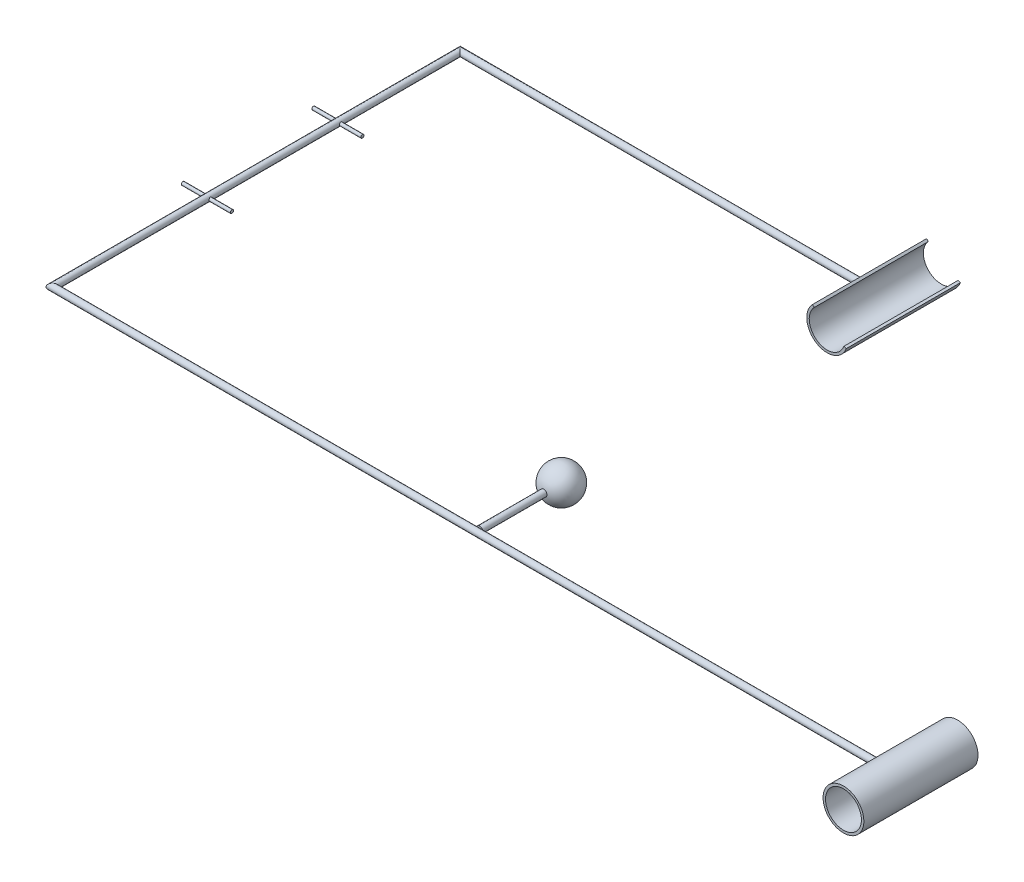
ISO-10303-21;
HEADER;
FILE_DESCRIPTION(('STEP AP214'),'2;1');
FILE_NAME('part.step','',(''),(''),'','','');
FILE_SCHEMA(('AUTOMOTIVE_DESIGN { 1 0 10303 214 1 1 1 1 }'));
ENDSEC;
DATA;
#1=APPLICATION_CONTEXT('core data for automotive mechanical design processes');
#2=APPLICATION_PROTOCOL_DEFINITION('international standard','automotive_design',2000,#1);
#3=PRODUCT_CONTEXT('',#1,'mechanical');
#4=PRODUCT('Part','Part','',(#3));
#5=PRODUCT_RELATED_PRODUCT_CATEGORY('part','',(#4));
#6=PRODUCT_DEFINITION_FORMATION('','',#4);
#7=PRODUCT_DEFINITION_CONTEXT('part definition',#1,'design');
#8=PRODUCT_DEFINITION('design','',#6,#7);
#9=PRODUCT_DEFINITION_SHAPE('','',#8);
#10=(LENGTH_UNIT() NAMED_UNIT(*) SI_UNIT(.MILLI.,.METRE.));
#11=(NAMED_UNIT(*) PLANE_ANGLE_UNIT() SI_UNIT($,.RADIAN.));
#12=(NAMED_UNIT(*) SI_UNIT($,.STERADIAN.) SOLID_ANGLE_UNIT());
#13=UNCERTAINTY_MEASURE_WITH_UNIT(LENGTH_MEASURE(1.E-05),#10,'distance_accuracy_value','');
#14=(GEOMETRIC_REPRESENTATION_CONTEXT(3) GLOBAL_UNCERTAINTY_ASSIGNED_CONTEXT((#13)) GLOBAL_UNIT_ASSIGNED_CONTEXT((#10,
#11,#12)) REPRESENTATION_CONTEXT('',''));
#15=CARTESIAN_POINT('',(0.,0.,0.));
#16=DIRECTION('',(0.,0.,1.));
#17=DIRECTION('',(1.,0.,0.));
#18=AXIS2_PLACEMENT_3D('',#15,#16,#17);
#19=CARTESIAN_POINT('',(0.,0.,-35.));
#20=DIRECTION('',(0.,0.,1.));
#21=DIRECTION('',(1.,0.,0.));
#22=AXIS2_PLACEMENT_3D('',#19,#20,#21);
#23=CYLINDRICAL_SURFACE('',#22,11.);
#24=CARTESIAN_POINT('',(0.,0.,35.));
#25=DIRECTION('',(0.,0.,1.));
#26=DIRECTION('',(1.,0.,0.));
#27=AXIS2_PLACEMENT_3D('',#24,#25,#26);
#28=CIRCLE('',#27,11.);
#29=CARTESIAN_POINT('',(11.,0.,35.));
#30=VERTEX_POINT('',#29);
#31=EDGE_CURVE('P0_E332',#30,#30,#28,.F.);
#32=ORIENTED_EDGE('',*,*,#31,.F.);
#33=EDGE_LOOP('',(#32));
#34=FACE_BOUND('',#33,.T.);
#35=CARTESIAN_POINT('',(0.,0.,-35.));
#36=DIRECTION('',(0.,0.,1.));
#37=DIRECTION('',(1.,0.,0.));
#38=AXIS2_PLACEMENT_3D('',#35,#36,#37);
#39=CIRCLE('',#38,11.);
#40=CARTESIAN_POINT('',(11.,0.,-35.));
#41=VERTEX_POINT('',#40);
#42=EDGE_CURVE('P0_E21',#41,#41,#39,.T.);
#43=ORIENTED_EDGE('',*,*,#42,.F.);
#44=EDGE_LOOP('',(#43));
#45=FACE_BOUND('',#44,.T.);
#46=ADVANCED_FACE('P0_F17',(#34,#45),#23,.F.);
#47=CARTESIAN_POINT('',(13.75,-13.75,-35.));
#48=DIRECTION('',(0.,0.,-1.));
#49=DIRECTION('',(-1.,0.,0.));
#50=AXIS2_PLACEMENT_3D('',#47,#48,#49);
#51=PLANE('',#50);
#52=ORIENTED_EDGE('',*,*,#42,.T.);
#53=EDGE_LOOP('',(#52));
#54=FACE_BOUND('',#53,.T.);
#55=CARTESIAN_POINT('',(0.,0.,-35.));
#56=DIRECTION('',(0.,0.,1.));
#57=DIRECTION('',(0.,-1.,0.));
#58=AXIS2_PLACEMENT_3D('',#55,#56,#57);
#59=CIRCLE('',#58,12.5);
#60=CARTESIAN_POINT('',(0.,-12.5,-35.));
#61=VERTEX_POINT('',#60);
#62=EDGE_CURVE('P0_E335',#61,#61,#59,.T.);
#63=ORIENTED_EDGE('',*,*,#62,.F.);
#64=EDGE_LOOP('',(#63));
#65=FACE_BOUND('',#64,.T.);
#66=ADVANCED_FACE('P0_F313',(#54,#65),#51,.T.);
#67=CARTESIAN_POINT('',(-13.75,-13.75,35.));
#68=DIRECTION('',(0.,0.,1.));
#69=DIRECTION('',(1.,0.,0.));
#70=AXIS2_PLACEMENT_3D('',#67,#68,#69);
#71=PLANE('',#70);
#72=ORIENTED_EDGE('',*,*,#31,.T.);
#73=EDGE_LOOP('',(#72));
#74=FACE_BOUND('',#73,.T.);
#75=CARTESIAN_POINT('',(0.,0.,35.));
#76=DIRECTION('',(0.,0.,1.));
#77=DIRECTION('',(0.,-1.,0.));
#78=AXIS2_PLACEMENT_3D('',#75,#76,#77);
#79=CIRCLE('',#78,12.5);
#80=CARTESIAN_POINT('',(0.,-12.5,35.));
#81=VERTEX_POINT('',#80);
#82=EDGE_CURVE('P0_E196',#81,#81,#79,.F.);
#83=ORIENTED_EDGE('',*,*,#82,.F.);
#84=EDGE_LOOP('',(#83));
#85=FACE_BOUND('',#84,.T.);
#86=ADVANCED_FACE('P0_F223',(#74,#85),#71,.T.);
#87=CARTESIAN_POINT('',(0.,0.,35.));
#88=DIRECTION('',(0.,0.,1.));
#89=DIRECTION('',(0.,-1.,0.));
#90=AXIS2_PLACEMENT_3D('',#87,#88,#89);
#91=CYLINDRICAL_SURFACE('',#90,12.5);
#92=ORIENTED_EDGE('',*,*,#82,.T.);
#93=EDGE_LOOP('',(#92));
#94=FACE_BOUND('',#93,.T.);
#95=CARTESIAN_POINT('',(-12.3389626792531,2.,0.));
#96=CARTESIAN_POINT('',(-12.3389646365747,1.99999546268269,-0.1115667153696));
#97=CARTESIAN_POINT('',(-12.3404922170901,1.99063305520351,-0.223195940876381));
#98=CARTESIAN_POINT('',(-12.3464325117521,1.95344445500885,-0.443326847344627));
#99=CARTESIAN_POINT('',(-12.3508479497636,1.92560083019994,-0.551825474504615));
#100=CARTESIAN_POINT('',(-12.3620513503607,1.85230972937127,-0.762477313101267));
#101=CARTESIAN_POINT('',(-12.3688373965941,1.8068764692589,-0.864635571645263));
#102=CARTESIAN_POINT('',(-12.3840151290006,1.6997304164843,-1.05986648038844));
#103=CARTESIAN_POINT('',(-12.3924066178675,1.63801962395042,-1.15294024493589));
#104=CARTESIAN_POINT('',(-12.409935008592,1.49947140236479,-1.32821893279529));
#105=CARTESIAN_POINT('',(-12.4190774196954,1.42251498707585,-1.41032926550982));
#106=CARTESIAN_POINT('',(-12.4370285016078,1.25591709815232,-1.56052945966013));
#107=CARTESIAN_POINT('',(-12.4458371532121,1.16627489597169,-1.62861851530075));
#108=CARTESIAN_POINT('',(-12.4621862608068,0.976239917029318,-1.7491959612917));
#109=CARTESIAN_POINT('',(-12.4697194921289,0.875790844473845,-1.80159669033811));
#110=CARTESIAN_POINT('',(-12.4826077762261,0.667375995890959,-1.88874693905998));
#111=CARTESIAN_POINT('',(-12.4879629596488,0.559410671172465,-1.92349751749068));
#112=CARTESIAN_POINT('',(-12.4958528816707,0.340004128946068,-1.97407274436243));
#113=CARTESIAN_POINT('',(-12.49841126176,0.228600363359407,-1.99005611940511));
#114=CARTESIAN_POINT('',(-12.500500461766,0.00466480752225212,-2.00313650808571));
#115=CARTESIAN_POINT('',(-12.5000314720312,-0.10786691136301,-2.00023470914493));
#116=CARTESIAN_POINT('',(-12.4961375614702,-0.329779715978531,-1.97575151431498));
#117=CARTESIAN_POINT('',(-12.4927396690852,-0.439180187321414,-1.95434091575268));
#118=CARTESIAN_POINT('',(-12.4833998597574,-0.652815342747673,-1.89371648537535));
#119=CARTESIAN_POINT('',(-12.4774578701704,-0.757049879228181,-1.85450214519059));
#120=CARTESIAN_POINT('',(-12.4636513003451,-0.957905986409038,-1.75921154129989));
#121=CARTESIAN_POINT('',(-12.4557786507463,-1.05449329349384,-1.70306427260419));
#122=CARTESIAN_POINT('',(-12.4389865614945,-1.23693967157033,-1.57555357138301));
#123=CARTESIAN_POINT('',(-12.4300670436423,-1.32279794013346,-1.50418900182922));
#124=CARTESIAN_POINT('',(-12.4120565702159,-1.48235721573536,-1.34732043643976));
#125=CARTESIAN_POINT('',(-12.4029648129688,-1.555911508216,-1.2616672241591));
#126=CARTESIAN_POINT('',(-12.3857313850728,-1.68762680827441,-1.07915724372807));
#127=CARTESIAN_POINT('',(-12.3775897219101,-1.74578769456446,-0.982300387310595));
#128=CARTESIAN_POINT('',(-12.3631781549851,-1.84509031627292,-0.779969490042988));
#129=CARTESIAN_POINT('',(-12.3569100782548,-1.88621545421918,-0.674487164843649));
#130=CARTESIAN_POINT('',(-12.3469864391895,-1.95012354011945,-0.457989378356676));
#131=CARTESIAN_POINT('',(-12.343330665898,-1.9729079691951,-0.346974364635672));
#132=CARTESIAN_POINT('',(-12.3390860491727,-1.99928349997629,-0.123872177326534));
#133=CARTESIAN_POINT('',(-12.338463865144,-2.0030832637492,-0.0118102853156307));
#134=CARTESIAN_POINT('',(-12.3402681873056,-1.99193667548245,0.211348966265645));
#135=CARTESIAN_POINT('',(-12.3426945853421,-1.97699098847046,0.322446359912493));
#136=CARTESIAN_POINT('',(-12.3502919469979,-1.92895527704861,0.539866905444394));
#137=CARTESIAN_POINT('',(-12.3554469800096,-1.89597053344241,0.646213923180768));
#138=CARTESIAN_POINT('',(-12.3679074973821,-1.81290306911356,0.85187038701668));
#139=CARTESIAN_POINT('',(-12.3752131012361,-1.76281939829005,0.951179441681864));
#140=CARTESIAN_POINT('',(-12.3912295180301,-1.64647965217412,1.14087239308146));
#141=CARTESIAN_POINT('',(-12.3999517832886,-1.58008930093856,1.23117295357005));
#142=CARTESIAN_POINT('',(-12.4177848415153,-1.43320604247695,1.39942606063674));
#143=CARTESIAN_POINT('',(-12.426895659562,-1.35271222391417,1.47737780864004));
#144=CARTESIAN_POINT('',(-12.4445842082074,-1.17898475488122,1.61947729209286));
#145=CARTESIAN_POINT('',(-12.4531560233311,-1.08563688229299,1.68348622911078));
#146=CARTESIAN_POINT('',(-12.4687070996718,-0.889391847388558,1.7949130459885));
#147=CARTESIAN_POINT('',(-12.4756864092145,-0.786494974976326,1.8423314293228));
#148=CARTESIAN_POINT('',(-12.4872402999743,-0.57449377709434,1.91901272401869));
#149=CARTESIAN_POINT('',(-12.491824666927,-0.46541676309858,1.94834960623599));
#150=CARTESIAN_POINT('',(-12.4981133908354,-0.243805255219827,1.98827383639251));
#151=CARTESIAN_POINT('',(-12.4998179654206,-0.131271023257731,1.99886260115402));
#152=CARTESIAN_POINT('',(-12.5001523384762,0.0927181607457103,2.00095179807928));
#153=CARTESIAN_POINT('',(-12.4988162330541,0.204171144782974,1.99266389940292));
#154=CARTESIAN_POINT('',(-12.4932886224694,0.424076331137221,1.95769116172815));
#155=CARTESIAN_POINT('',(-12.4890971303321,0.532528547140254,1.93100640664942));
#156=CARTESIAN_POINT('',(-12.4783277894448,0.743282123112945,1.86007617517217));
#157=CARTESIAN_POINT('',(-12.471752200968,0.845589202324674,1.81584732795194));
#158=CARTESIAN_POINT('',(-12.4569342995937,1.0413631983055,1.71110753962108));
#159=CARTESIAN_POINT('',(-12.4486919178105,1.13482974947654,1.65059592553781));
#160=CARTESIAN_POINT('',(-12.4313454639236,1.31133889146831,1.51425167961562));
#161=CARTESIAN_POINT('',(-12.4222331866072,1.39426053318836,1.4382634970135));
#162=CARTESIAN_POINT('',(-12.4042323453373,1.54625119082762,1.27345013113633));
#163=CARTESIAN_POINT('',(-12.3953438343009,1.61531695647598,1.18462194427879));
#164=CARTESIAN_POINT('',(-12.3787350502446,1.73804191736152,0.995970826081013));
#165=CARTESIAN_POINT('',(-12.3710226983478,1.79159866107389,0.896080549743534));
#166=CARTESIAN_POINT('',(-12.35773272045,1.88109182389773,0.68864171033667));
#167=CARTESIAN_POINT('',(-12.3521529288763,1.91704612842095,0.581101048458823));
#168=CARTESIAN_POINT('',(-12.3450187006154,1.96235985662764,0.394262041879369));
#169=CARTESIAN_POINT('',(-12.3427600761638,1.97645270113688,0.316104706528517));
#170=CARTESIAN_POINT('',(-12.339731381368,1.99527431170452,0.158642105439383));
#171=CARTESIAN_POINT('',(-12.3389612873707,2.00000322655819,0.0793368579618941));
#172=CARTESIAN_POINT('',(-12.3389626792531,2.,0.));
#173=B_SPLINE_CURVE_WITH_KNOTS('',3,(#95,#96,#97,#98,#99,#100,#101,#102,#103,#104,#105,#106,
#107,#108,#109,#110,#111,#112,#113,#114,#115,#116,#117,#118,#119,#120,#121,#122,#123,#124,#125,
#126,#127,#128,#129,#130,#131,#132,#133,#134,#135,#136,#137,#138,#139,#140,#141,#142,#143,#144,
#145,#146,#147,#148,#149,#150,#151,#152,#153,#154,#155,#156,#157,#158,#159,#160,#161,#162,#163,
#164,#165,#166,#167,#168,#169,#170,#171,#172),.UNSPECIFIED.,.T.,.F.,(4,2,2,2,2,2,2,2,2,2,2,2,2,
2,2,2,2,2,2,2,2,2,2,2,2,2,2,2,2,2,2,2,2,2,2,2,2,2,4),(0.,0.334410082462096,0.66913604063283,
1.00359203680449,1.33800695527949,1.6751426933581,2.01229780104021,2.35130309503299,
2.69028805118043,3.02638485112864,3.36246051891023,3.69546762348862,4.0284842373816,
4.3629171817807,4.69737512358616,5.03557384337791,5.37377522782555,5.71230534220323,
6.05080811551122,6.3855820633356,6.72034413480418,7.05317297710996,7.38602031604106,
7.7217061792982,8.05741374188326,8.39632425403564,8.73522448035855,9.07272891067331,
9.41020783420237,9.74392117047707,10.0776329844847,10.4110292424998,10.7444392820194,
11.0813822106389,11.4184040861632,11.7576040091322,12.0964585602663,12.3342666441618,
12.5720709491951),.UNSPECIFIED.);
#174=CARTESIAN_POINT('',(-12.3389626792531,2.,0.));
#175=VERTEX_POINT('',#174);
#176=EDGE_CURVE('P0_E190',#175,#175,#173,.T.);
#177=ORIENTED_EDGE('',*,*,#176,.F.);
#178=EDGE_LOOP('',(#177));
#179=FACE_BOUND('',#178,.T.);
#180=ORIENTED_EDGE('',*,*,#62,.T.);
#181=EDGE_LOOP('',(#180));
#182=FACE_BOUND('',#181,.T.);
#183=ADVANCED_FACE('P0_F198',(#94,#179,#182),#91,.T.);
#184=CARTESIAN_POINT('',(-505.,-1.1,-173.9));
#185=DIRECTION('',(1.,0.,0.));
#186=DIRECTION('',(0.,0.,-1.));
#187=AXIS2_PLACEMENT_3D('',#184,#185,#186);
#188=PLANE('',#187);
#189=CARTESIAN_POINT('',(-505.,0.,-175.));
#190=DIRECTION('',(1.,0.,0.));
#191=DIRECTION('',(0.,0.,-1.));
#192=AXIS2_PLACEMENT_3D('',#189,#190,#191);
#193=CIRCLE('',#192,1.);
#194=CARTESIAN_POINT('',(-505.,0.,-176.));
#195=VERTEX_POINT('',#194);
#196=EDGE_CURVE('P0_E185',#195,#195,#193,.F.);
#197=ORIENTED_EDGE('',*,*,#196,.F.);
#198=EDGE_LOOP('',(#197));
#199=FACE_BOUND('',#198,.T.);
#200=ADVANCED_FACE('P0_F216',(#199),#188,.T.);
#201=CARTESIAN_POINT('',(-535.,-1.1,-176.1));
#202=DIRECTION('',(-1.,0.,0.));
#203=DIRECTION('',(0.,0.,1.));
#204=AXIS2_PLACEMENT_3D('',#201,#202,#203);
#205=PLANE('',#204);
#206=CARTESIAN_POINT('',(-535.,0.,-175.000000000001));
#207=DIRECTION('',(1.,0.,0.));
#208=DIRECTION('',(0.,0.,-1.));
#209=AXIS2_PLACEMENT_3D('',#206,#207,#208);
#210=CIRCLE('',#209,1.);
#211=CARTESIAN_POINT('',(-535.,0.,-176.000000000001));
#212=VERTEX_POINT('',#211);
#213=EDGE_CURVE('P0_E179',#212,#212,#210,.T.);
#214=ORIENTED_EDGE('',*,*,#213,.F.);
#215=EDGE_LOOP('',(#214));
#216=FACE_BOUND('',#215,.T.);
#217=ADVANCED_FACE('P0_F214',(#216),#205,.T.);
#218=CARTESIAN_POINT('',(-505.,-1.1,-93.9));
#219=DIRECTION('',(1.,0.,0.));
#220=DIRECTION('',(0.,0.,-1.));
#221=AXIS2_PLACEMENT_3D('',#218,#219,#220);
#222=PLANE('',#221);
#223=CARTESIAN_POINT('',(-505.,0.,-95.));
#224=DIRECTION('',(1.,0.,0.));
#225=DIRECTION('',(0.,0.,-1.));
#226=AXIS2_PLACEMENT_3D('',#223,#224,#225);
#227=CIRCLE('',#226,1.);
#228=CARTESIAN_POINT('',(-505.,0.,-96.));
#229=VERTEX_POINT('',#228);
#230=EDGE_CURVE('P0_E176',#229,#229,#227,.F.);
#231=ORIENTED_EDGE('',*,*,#230,.F.);
#232=EDGE_LOOP('',(#231));
#233=FACE_BOUND('',#232,.T.);
#234=ADVANCED_FACE('P0_F210',(#233),#222,.T.);
#235=CARTESIAN_POINT('',(-535.,-1.1,-96.1));
#236=DIRECTION('',(-1.,0.,0.));
#237=DIRECTION('',(0.,0.,1.));
#238=AXIS2_PLACEMENT_3D('',#235,#236,#237);
#239=PLANE('',#238);
#240=CARTESIAN_POINT('',(-535.,0.,-95.0000000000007));
#241=DIRECTION('',(1.,0.,0.));
#242=DIRECTION('',(0.,0.,-1.));
#243=AXIS2_PLACEMENT_3D('',#240,#241,#242);
#244=CIRCLE('',#243,1.);
#245=CARTESIAN_POINT('',(-535.,0.,-96.0000000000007));
#246=VERTEX_POINT('',#245);
#247=EDGE_CURVE('P0_E178',#246,#246,#244,.T.);
#248=ORIENTED_EDGE('',*,*,#247,.F.);
#249=EDGE_LOOP('',(#248));
#250=FACE_BOUND('',#249,.T.);
#251=ADVANCED_FACE('P0_F206',(#250),#239,.T.);
#252=CARTESIAN_POINT('',(-9.28099643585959,0.,0.));
#253=DIRECTION('',(1.,0.,0.));
#254=DIRECTION('',(0.,0.,-1.));
#255=AXIS2_PLACEMENT_3D('',#252,#253,#254);
#256=CYLINDRICAL_SURFACE('',#255,2.);
#257=ORIENTED_EDGE('',*,*,#176,.T.);
#258=EDGE_LOOP('',(#257));
#259=FACE_BOUND('',#258,.T.);
#260=CARTESIAN_POINT('',(-520.,0.,0.));
#261=DIRECTION('',(0.707106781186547,0.,0.707106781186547));
#262=DIRECTION('',(-0.707106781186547,0.,0.707106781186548));
#263=AXIS2_PLACEMENT_3D('',#260,#261,#262);
#264=ELLIPSE('',#263,2.82842712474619,2.);
#265=CARTESIAN_POINT('',(-522.,0.,2.));
#266=VERTEX_POINT('',#265);
#267=EDGE_CURVE('P0_E182',#266,#266,#264,.F.);
#268=ORIENTED_EDGE('',*,*,#267,.F.);
#269=EDGE_LOOP('',(#268));
#270=FACE_BOUND('',#269,.T.);
#271=ADVANCED_FACE('P0_F202',(#259,#270),#256,.T.);
#272=CARTESIAN_POINT('',(-505.,0.,-175.));
#273=DIRECTION('',(1.,0.,0.));
#274=DIRECTION('',(0.,0.,-1.));
#275=AXIS2_PLACEMENT_3D('',#272,#273,#274);
#276=CYLINDRICAL_SURFACE('',#275,1.);
#277=CARTESIAN_POINT('',(-518.267949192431,1.,-175.));
#278=CARTESIAN_POINT('',(-518.267944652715,0.999996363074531,-175.052107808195));
#279=CARTESIAN_POINT('',(-518.265561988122,0.995899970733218,-175.104281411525));
#280=CARTESIAN_POINT('',(-518.256376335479,0.979723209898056,-175.207027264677));
#281=CARTESIAN_POINT('',(-518.249564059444,0.967626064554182,-175.257595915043));
#282=CARTESIAN_POINT('',(-518.232506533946,0.936099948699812,-175.355451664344));
#283=CARTESIAN_POINT('',(-518.222279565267,0.916709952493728,-175.402754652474));
#284=CARTESIAN_POINT('',(-518.199573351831,0.871267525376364,-175.493424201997));
#285=CARTESIAN_POINT('',(-518.187093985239,0.845214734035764,-175.536790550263));
#286=CARTESIAN_POINT('',(-518.160031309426,0.784666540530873,-175.622305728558));
#287=CARTESIAN_POINT('',(-518.145359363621,0.749652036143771,-175.664059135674));
#288=CARTESIAN_POINT('',(-518.116280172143,0.673253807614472,-175.741408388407));
#289=CARTESIAN_POINT('',(-518.101873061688,0.631866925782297,-175.777001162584));
#290=CARTESIAN_POINT('',(-518.073785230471,0.540489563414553,-175.843367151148));
#291=CARTESIAN_POINT('',(-518.060218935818,0.490107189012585,-175.87365376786));
#292=CARTESIAN_POINT('',(-518.036492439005,0.384157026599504,-175.925140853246));
#293=CARTESIAN_POINT('',(-518.026330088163,0.328592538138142,-175.946347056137));
#294=CARTESIAN_POINT('',(-518.011195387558,0.218044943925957,-175.977504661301));
#295=CARTESIAN_POINT('',(-518.005905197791,0.163301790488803,-175.988149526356));
#296=CARTESIAN_POINT('',(-517.999924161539,0.0525706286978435,-176.000166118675));
#297=CARTESIAN_POINT('',(-517.999230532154,-0.00341660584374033,-176.001543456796));
#298=CARTESIAN_POINT('',(-518.002370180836,-0.109832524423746,-175.99525332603));
#299=CARTESIAN_POINT('',(-518.005815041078,-0.160321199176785,-175.988361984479));
#300=CARTESIAN_POINT('',(-518.016257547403,-0.259313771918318,-175.967119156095));
#301=CARTESIAN_POINT('',(-518.023255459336,-0.307817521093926,-175.952767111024));
#302=CARTESIAN_POINT('',(-518.040284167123,-0.402309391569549,-175.91691743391));
#303=CARTESIAN_POINT('',(-518.050355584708,-0.448253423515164,-175.895323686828));
#304=CARTESIAN_POINT('',(-518.072623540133,-0.535976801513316,-175.845736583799));
#305=CARTESIAN_POINT('',(-518.084820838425,-0.577754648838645,-175.817740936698));
#306=CARTESIAN_POINT('',(-518.111556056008,-0.660173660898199,-175.753104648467));
#307=CARTESIAN_POINT('',(-518.126206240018,-0.700334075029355,-175.715896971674));
#308=CARTESIAN_POINT('',(-518.155456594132,-0.774104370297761,-175.63541027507));
#309=CARTESIAN_POINT('',(-518.170056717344,-0.80770921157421,-175.592126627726));
#310=CARTESIAN_POINT('',(-518.198558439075,-0.869505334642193,-175.497351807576));
#311=CARTESIAN_POINT('',(-518.212356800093,-0.897217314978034,-175.445513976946));
#312=CARTESIAN_POINT('',(-518.236245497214,-0.943319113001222,-175.337062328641));
#313=CARTESIAN_POINT('',(-518.246339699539,-0.961718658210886,-175.280453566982));
#314=CARTESIAN_POINT('',(-518.26055364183,-0.987180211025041,-175.168785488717));
#315=CARTESIAN_POINT('',(-518.265083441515,-0.995025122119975,-175.113958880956));
#316=CARTESIAN_POINT('',(-518.268820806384,-1.00151694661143,-175.003598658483));
#317=CARTESIAN_POINT('',(-518.268032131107,-1.00017035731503,-174.94806557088));
#318=CARTESIAN_POINT('',(-518.261656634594,-0.989036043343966,-174.844346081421));
#319=CARTESIAN_POINT('',(-518.256604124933,-0.980187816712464,-174.796020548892));
#320=CARTESIAN_POINT('',(-518.243059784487,-0.955696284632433,-174.701632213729));
#321=CARTESIAN_POINT('',(-518.23456683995,-0.940050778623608,-174.655570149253));
#322=CARTESIAN_POINT('',(-518.214637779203,-0.901647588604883,-174.564588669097));
#323=CARTESIAN_POINT('',(-518.203083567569,-0.878594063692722,-174.519820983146));
#324=CARTESIAN_POINT('',(-518.178438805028,-0.826287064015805,-174.434530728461));
#325=CARTESIAN_POINT('',(-518.165347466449,-0.797030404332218,-174.394010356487));
#326=CARTESIAN_POINT('',(-518.137120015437,-0.728837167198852,-174.313021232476));
#327=CARTESIAN_POINT('',(-518.121934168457,-0.689145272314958,-174.273202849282));
#328=CARTESIAN_POINT('',(-518.092657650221,-0.60340449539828,-174.200587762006));
#329=CARTESIAN_POINT('',(-518.078567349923,-0.557353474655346,-174.167793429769));
#330=CARTESIAN_POINT('',(-518.05258638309,-0.45853536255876,-174.10942627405));
#331=CARTESIAN_POINT('',(-518.04076358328,-0.405623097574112,-174.084066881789));
#332=CARTESIAN_POINT('',(-518.021166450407,-0.29552236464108,-174.042862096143));
#333=CARTESIAN_POINT('',(-518.013388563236,-0.238337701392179,-174.027008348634));
#334=CARTESIAN_POINT('',(-518.003324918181,-0.126979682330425,-174.006631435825));
#335=CARTESIAN_POINT('',(-518.000600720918,-0.0730114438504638,-174.001202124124));
#336=CARTESIAN_POINT('',(-517.999578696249,0.0351259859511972,-173.999156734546));
#337=CARTESIAN_POINT('',(-518.001279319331,0.0892951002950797,-174.002537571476));
#338=CARTESIAN_POINT('',(-518.008660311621,0.192537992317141,-174.017416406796));
#339=CARTESIAN_POINT('',(-518.01407105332,0.241712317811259,-174.028364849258));
#340=CARTESIAN_POINT('',(-518.028079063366,0.337445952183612,-174.057326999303));
#341=CARTESIAN_POINT('',(-518.036676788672,0.384004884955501,-174.075341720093));
#342=CARTESIAN_POINT('',(-518.056740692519,0.475423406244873,-174.118727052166));
#343=CARTESIAN_POINT('',(-518.068313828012,0.520125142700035,-174.144379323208));
#344=CARTESIAN_POINT('',(-518.093118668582,0.60477464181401,-174.201957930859));
#345=CARTESIAN_POINT('',(-518.106351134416,0.644720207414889,-174.233887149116));
#346=CARTESIAN_POINT('',(-518.134713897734,0.722914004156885,-174.306797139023));
#347=CARTESIAN_POINT('',(-518.149902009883,0.760597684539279,-174.348362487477));
#348=CARTESIAN_POINT('',(-518.179369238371,0.828663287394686,-174.43745072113));
#349=CARTESIAN_POINT('',(-518.193647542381,0.85903875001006,-174.484978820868));
#350=CARTESIAN_POINT('',(-518.220003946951,0.912431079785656,-174.586636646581));
#351=CARTESIAN_POINT('',(-518.231998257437,0.935185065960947,-174.640927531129));
#352=CARTESIAN_POINT('',(-518.251338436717,0.970878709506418,-174.75333240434));
#353=CARTESIAN_POINT('',(-518.258699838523,0.983851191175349,-174.811432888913));
#354=CARTESIAN_POINT('',(-518.264707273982,0.994367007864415,-174.891805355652));
#355=CARTESIAN_POINT('',(-518.265918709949,0.996476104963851,-174.913367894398));
#356=CARTESIAN_POINT('',(-518.267540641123,0.999293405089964,-174.956616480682));
#357=CARTESIAN_POINT('',(-518.267951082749,1.00000151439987,-174.978302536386));
#358=CARTESIAN_POINT('',(-518.267949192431,1.,-175.));
#359=B_SPLINE_CURVE_WITH_KNOTS('',3,(#277,#278,#279,#280,#281,#282,#283,#284,#285,#286,#287,
#288,#289,#290,#291,#292,#293,#294,#295,#296,#297,#298,#299,#300,#301,#302,#303,#304,#305,#306,
#307,#308,#309,#310,#311,#312,#313,#314,#315,#316,#317,#318,#319,#320,#321,#322,#323,#324,#325,
#326,#327,#328,#329,#330,#331,#332,#333,#334,#335,#336,#337,#338,#339,#340,#341,#342,#343,#344,
#345,#346,#347,#348,#349,#350,#351,#352,#353,#354,#355,#356,#357,#358),.UNSPECIFIED.,.T.,.F.,(4,
2,2,2,2,2,2,2,2,2,2,2,2,2,2,2,2,2,2,2,2,2,2,2,2,2,2,2,2,2,2,2,2,2,2,2,2,2,2,2,4),(0.,
0.156232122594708,0.312792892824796,0.468528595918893,0.624272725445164,0.792862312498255,
0.961535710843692,1.14157892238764,1.32150826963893,1.48863484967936,1.65566023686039,
1.80816097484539,1.96067312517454,2.11529534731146,2.26997299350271,2.4392719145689,
2.60870048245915,2.78888841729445,2.96888774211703,3.1346229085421,3.30024093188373,
3.44774183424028,3.59529052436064,3.74967296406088,3.90413486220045,4.07806743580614,
4.25205864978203,4.43064181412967,4.6090677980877,4.77112270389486,4.93312086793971,
5.08444424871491,5.23578933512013,5.39360750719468,5.55149830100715,5.72510241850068,
5.89885942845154,6.0781074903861,6.25675133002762,6.32180135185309,6.38685572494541),.UNSPECIFIED.);
#360=CARTESIAN_POINT('',(-518.267949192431,1.,-175.));
#361=VERTEX_POINT('',#360);
#362=EDGE_CURVE('P0_E145',#361,#361,#359,.T.);
#363=ORIENTED_EDGE('',*,*,#362,.F.);
#364=EDGE_LOOP('',(#363));
#365=FACE_BOUND('',#364,.T.);
#366=ORIENTED_EDGE('',*,*,#196,.T.);
#367=EDGE_LOOP('',(#366));
#368=FACE_BOUND('',#367,.T.);
#369=ADVANCED_FACE('P0_F160',(#365,#368),#276,.T.);
#370=CARTESIAN_POINT('',(-521.652443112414,0.,-175.));
#371=DIRECTION('',(1.,0.,0.));
#372=DIRECTION('',(0.,0.,-1.));
#373=AXIS2_PLACEMENT_3D('',#370,#371,#372);
#374=CYLINDRICAL_SURFACE('',#373,1.);
#375=CARTESIAN_POINT('',(-521.732050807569,1.,-175.));
#376=CARTESIAN_POINT('',(-521.732055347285,0.999996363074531,-174.947892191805));
#377=CARTESIAN_POINT('',(-521.734438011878,0.995899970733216,-174.895718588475));
#378=CARTESIAN_POINT('',(-521.743623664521,0.979723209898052,-174.792972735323));
#379=CARTESIAN_POINT('',(-521.750435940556,0.967626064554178,-174.742404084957));
#380=CARTESIAN_POINT('',(-521.767493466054,0.936099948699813,-174.644548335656));
#381=CARTESIAN_POINT('',(-521.777720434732,0.916709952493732,-174.597245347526));
#382=CARTESIAN_POINT('',(-521.800426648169,0.871267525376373,-174.506575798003));
#383=CARTESIAN_POINT('',(-521.812906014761,0.845214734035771,-174.463209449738));
#384=CARTESIAN_POINT('',(-521.839968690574,0.784666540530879,-174.377694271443));
#385=CARTESIAN_POINT('',(-521.85464063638,0.74965203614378,-174.335940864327));
#386=CARTESIAN_POINT('',(-521.883719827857,0.673253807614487,-174.258591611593));
#387=CARTESIAN_POINT('',(-521.898126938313,0.631866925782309,-174.222998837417));
#388=CARTESIAN_POINT('',(-521.926214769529,0.540489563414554,-174.156632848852));
#389=CARTESIAN_POINT('',(-521.939781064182,0.490107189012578,-174.126346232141));
#390=CARTESIAN_POINT('',(-521.963507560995,0.384157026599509,-174.074859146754));
#391=CARTESIAN_POINT('',(-521.973669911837,0.328592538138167,-174.053652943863));
#392=CARTESIAN_POINT('',(-521.988804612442,0.218044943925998,-174.022495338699));
#393=CARTESIAN_POINT('',(-521.994094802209,0.16330179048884,-174.011850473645));
#394=CARTESIAN_POINT('',(-522.000075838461,0.0525706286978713,-173.999833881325));
#395=CARTESIAN_POINT('',(-522.000769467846,-0.00341660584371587,-173.998456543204));
#396=CARTESIAN_POINT('',(-521.997629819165,-0.109832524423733,-174.00474667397));
#397=CARTESIAN_POINT('',(-521.994184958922,-0.160321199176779,-174.011638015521));
#398=CARTESIAN_POINT('',(-521.983742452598,-0.25931377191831,-174.032880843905));
#399=CARTESIAN_POINT('',(-521.976744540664,-0.30781752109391,-174.047232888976));
#400=CARTESIAN_POINT('',(-521.959715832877,-0.402309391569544,-174.08308256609));
#401=CARTESIAN_POINT('',(-521.949644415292,-0.448253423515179,-174.104676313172));
#402=CARTESIAN_POINT('',(-521.927376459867,-0.535976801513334,-174.154263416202));
#403=CARTESIAN_POINT('',(-521.915179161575,-0.577754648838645,-174.182259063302));
#404=CARTESIAN_POINT('',(-521.888443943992,-0.660173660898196,-174.246895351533));
#405=CARTESIAN_POINT('',(-521.873793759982,-0.700334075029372,-174.284103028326));
#406=CARTESIAN_POINT('',(-521.844543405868,-0.774104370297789,-174.36458972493));
#407=CARTESIAN_POINT('',(-521.829943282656,-0.807709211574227,-174.407873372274));
#408=CARTESIAN_POINT('',(-521.801441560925,-0.869505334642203,-174.502648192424));
#409=CARTESIAN_POINT('',(-521.787643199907,-0.897217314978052,-174.554486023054));
#410=CARTESIAN_POINT('',(-521.763754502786,-0.943319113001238,-174.662937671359));
#411=CARTESIAN_POINT('',(-521.753660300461,-0.961718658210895,-174.719546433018));
#412=CARTESIAN_POINT('',(-521.73944635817,-0.987180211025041,-174.831214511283));
#413=CARTESIAN_POINT('',(-521.734916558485,-0.995025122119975,-174.886041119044));
#414=CARTESIAN_POINT('',(-521.731179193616,-1.00151694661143,-174.996401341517));
#415=CARTESIAN_POINT('',(-521.731967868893,-1.00017035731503,-175.05193442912));
#416=CARTESIAN_POINT('',(-521.738343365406,-0.989036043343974,-175.155653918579));
#417=CARTESIAN_POINT('',(-521.743395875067,-0.980187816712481,-175.203979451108));
#418=CARTESIAN_POINT('',(-521.756940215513,-0.955696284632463,-175.298367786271));
#419=CARTESIAN_POINT('',(-521.76543316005,-0.940050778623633,-175.344429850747));
#420=CARTESIAN_POINT('',(-521.785362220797,-0.901647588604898,-175.435411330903));
#421=CARTESIAN_POINT('',(-521.796916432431,-0.878594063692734,-175.480179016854));
#422=CARTESIAN_POINT('',(-521.821561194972,-0.826287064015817,-175.565469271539));
#423=CARTESIAN_POINT('',(-521.834652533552,-0.797030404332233,-175.605989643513));
#424=CARTESIAN_POINT('',(-521.862879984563,-0.728837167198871,-175.686978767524));
#425=CARTESIAN_POINT('',(-521.878065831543,-0.689145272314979,-175.726797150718));
#426=CARTESIAN_POINT('',(-521.907342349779,-0.603404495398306,-175.799412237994));
#427=CARTESIAN_POINT('',(-521.921432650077,-0.557353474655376,-175.832206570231));
#428=CARTESIAN_POINT('',(-521.94741361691,-0.458535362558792,-175.89057372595));
#429=CARTESIAN_POINT('',(-521.95923641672,-0.40562309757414,-175.915933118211));
#430=CARTESIAN_POINT('',(-521.978833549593,-0.295522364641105,-175.957137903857));
#431=CARTESIAN_POINT('',(-521.986611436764,-0.238337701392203,-175.972991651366));
#432=CARTESIAN_POINT('',(-521.996675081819,-0.126979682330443,-175.993368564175));
#433=CARTESIAN_POINT('',(-521.999399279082,-0.0730114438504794,-175.998797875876));
#434=CARTESIAN_POINT('',(-522.000421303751,0.035125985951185,-176.000843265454));
#435=CARTESIAN_POINT('',(-521.998720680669,0.0892951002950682,-175.997462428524));
#436=CARTESIAN_POINT('',(-521.991339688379,0.192537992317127,-175.982583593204));
#437=CARTESIAN_POINT('',(-521.98592894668,0.241712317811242,-175.971635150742));
#438=CARTESIAN_POINT('',(-521.971920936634,0.337445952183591,-175.942673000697));
#439=CARTESIAN_POINT('',(-521.963323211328,0.384004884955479,-175.924658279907));
#440=CARTESIAN_POINT('',(-521.943259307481,0.475423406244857,-175.881272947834));
#441=CARTESIAN_POINT('',(-521.931686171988,0.520125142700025,-175.855620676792));
#442=CARTESIAN_POINT('',(-521.906881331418,0.604774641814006,-175.798042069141));
#443=CARTESIAN_POINT('',(-521.893648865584,0.644720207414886,-175.766112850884));
#444=CARTESIAN_POINT('',(-521.865286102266,0.722914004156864,-175.693202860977));
#445=CARTESIAN_POINT('',(-521.850097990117,0.76059768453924,-175.651637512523));
#446=CARTESIAN_POINT('',(-521.820630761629,0.828663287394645,-175.56254927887));
#447=CARTESIAN_POINT('',(-521.806352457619,0.859038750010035,-175.515021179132));
#448=CARTESIAN_POINT('',(-521.779996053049,0.912431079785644,-175.413363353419));
#449=CARTESIAN_POINT('',(-521.768001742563,0.935185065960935,-175.359072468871));
#450=CARTESIAN_POINT('',(-521.748661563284,0.97087870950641,-175.24666759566));
#451=CARTESIAN_POINT('',(-521.741300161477,0.983851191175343,-175.188567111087));
#452=CARTESIAN_POINT('',(-521.735292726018,0.994367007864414,-175.108194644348));
#453=CARTESIAN_POINT('',(-521.734081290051,0.996476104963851,-175.086632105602));
#454=CARTESIAN_POINT('',(-521.732459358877,0.999293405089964,-175.043383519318));
#455=CARTESIAN_POINT('',(-521.732048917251,1.00000151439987,-175.021697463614));
#456=CARTESIAN_POINT('',(-521.732050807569,1.,-175.));
#457=B_SPLINE_CURVE_WITH_KNOTS('',3,(#375,#376,#377,#378,#379,#380,#381,#382,#383,#384,#385,
#386,#387,#388,#389,#390,#391,#392,#393,#394,#395,#396,#397,#398,#399,#400,#401,#402,#403,#404,
#405,#406,#407,#408,#409,#410,#411,#412,#413,#414,#415,#416,#417,#418,#419,#420,#421,#422,#423,
#424,#425,#426,#427,#428,#429,#430,#431,#432,#433,#434,#435,#436,#437,#438,#439,#440,#441,#442,
#443,#444,#445,#446,#447,#448,#449,#450,#451,#452,#453,#454,#455,#456),.UNSPECIFIED.,.T.,.F.,(4,
2,2,2,2,2,2,2,2,2,2,2,2,2,2,2,2,2,2,2,2,2,2,2,2,2,2,2,2,2,2,2,2,2,2,2,2,2,2,2,4),(0.,
0.156232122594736,0.312792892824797,0.468528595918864,0.624272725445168,0.792862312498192,
0.961535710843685,1.14157892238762,1.32150826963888,1.48863484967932,1.65566023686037,
1.80816097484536,1.96067312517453,2.11529534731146,2.26997299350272,2.4392719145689,
2.60870048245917,2.7888884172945,2.96888774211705,3.13462290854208,3.30024093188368,
3.44774183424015,3.59529052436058,3.74967296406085,3.90413486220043,4.0780674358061,
4.25205864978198,4.43064181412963,4.60906779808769,4.77112270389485,4.9331208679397,
5.08444424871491,5.23578933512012,5.39360750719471,5.55149830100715,5.72510241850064,
5.8988594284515,6.07810749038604,6.25675133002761,6.32180135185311,6.38685572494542),.UNSPECIFIED.);
#458=CARTESIAN_POINT('',(-521.732050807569,1.,-175.));
#459=VERTEX_POINT('',#458);
#460=EDGE_CURVE('P0_E151',#459,#459,#457,.T.);
#461=ORIENTED_EDGE('',*,*,#460,.F.);
#462=EDGE_LOOP('',(#461));
#463=FACE_BOUND('',#462,.T.);
#464=ORIENTED_EDGE('',*,*,#213,.T.);
#465=EDGE_LOOP('',(#464));
#466=FACE_BOUND('',#465,.T.);
#467=ADVANCED_FACE('P0_F156',(#463,#466),#374,.T.);
#468=CARTESIAN_POINT('',(-505.,0.,-95.));
#469=DIRECTION('',(1.,0.,0.));
#470=DIRECTION('',(0.,0.,-1.));
#471=AXIS2_PLACEMENT_3D('',#468,#469,#470);
#472=CYLINDRICAL_SURFACE('',#471,1.);
#473=CARTESIAN_POINT('',(-518.267949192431,1.,-95.));
#474=CARTESIAN_POINT('',(-518.267944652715,0.999996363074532,-95.0521078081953));
#475=CARTESIAN_POINT('',(-518.265561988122,0.995899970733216,-95.1042814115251));
#476=CARTESIAN_POINT('',(-518.256376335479,0.979723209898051,-95.2070272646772));
#477=CARTESIAN_POINT('',(-518.249564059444,0.967626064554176,-95.2575959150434));
#478=CARTESIAN_POINT('',(-518.232506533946,0.93609994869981,-95.3554516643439));
#479=CARTESIAN_POINT('',(-518.222279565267,0.916709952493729,-95.4027546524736));
#480=CARTESIAN_POINT('',(-518.199573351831,0.871267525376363,-95.4934242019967));
#481=CARTESIAN_POINT('',(-518.187093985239,0.845214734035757,-95.5367905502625));
#482=CARTESIAN_POINT('',(-518.160031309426,0.784666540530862,-95.6223057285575));
#483=CARTESIAN_POINT('',(-518.145359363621,0.749652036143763,-95.6640591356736));
#484=CARTESIAN_POINT('',(-518.116280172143,0.673253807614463,-95.7414083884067));
#485=CARTESIAN_POINT('',(-518.101873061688,0.631866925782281,-95.7770011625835));
#486=CARTESIAN_POINT('',(-518.073785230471,0.540489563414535,-95.8433671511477));
#487=CARTESIAN_POINT('',(-518.060218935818,0.49010718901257,-95.8736537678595));
#488=CARTESIAN_POINT('',(-518.036492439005,0.384157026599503,-95.9251408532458));
#489=CARTESIAN_POINT('',(-518.026330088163,0.328592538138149,-95.9463470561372));
#490=CARTESIAN_POINT('',(-518.011195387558,0.218044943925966,-95.9775046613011));
#491=CARTESIAN_POINT('',(-518.005905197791,0.163301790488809,-95.9881495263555));
#492=CARTESIAN_POINT('',(-517.999924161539,0.0525706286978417,-96.000166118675));
#493=CARTESIAN_POINT('',(-517.999230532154,-0.00341660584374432,-96.0015434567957));
#494=CARTESIAN_POINT('',(-518.002370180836,-0.109832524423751,-95.9952533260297));
#495=CARTESIAN_POINT('',(-518.005815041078,-0.160321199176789,-95.9883619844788));
#496=CARTESIAN_POINT('',(-518.016257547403,-0.259313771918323,-95.9671191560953));
#497=CARTESIAN_POINT('',(-518.023255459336,-0.307817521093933,-95.9527671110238));
#498=CARTESIAN_POINT('',(-518.040284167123,-0.402309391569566,-95.9169174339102));
#499=CARTESIAN_POINT('',(-518.050355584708,-0.448253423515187,-95.8953236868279));
#500=CARTESIAN_POINT('',(-518.072623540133,-0.535976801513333,-95.8457365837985));
#501=CARTESIAN_POINT('',(-518.084820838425,-0.577754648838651,-95.8177409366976));
#502=CARTESIAN_POINT('',(-518.111556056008,-0.660173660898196,-95.753104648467));
#503=CARTESIAN_POINT('',(-518.126206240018,-0.700334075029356,-95.715896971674));
#504=CARTESIAN_POINT('',(-518.155456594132,-0.774104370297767,-95.6354102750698));
#505=CARTESIAN_POINT('',(-518.170056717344,-0.807709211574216,-95.592126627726));
#506=CARTESIAN_POINT('',(-518.198558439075,-0.869505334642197,-95.4973518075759));
#507=CARTESIAN_POINT('',(-518.212356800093,-0.897217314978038,-95.4455139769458));
#508=CARTESIAN_POINT('',(-518.236245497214,-0.943319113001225,-95.337062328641));
#509=CARTESIAN_POINT('',(-518.246339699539,-0.961718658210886,-95.2804535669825));
#510=CARTESIAN_POINT('',(-518.26055364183,-0.98718021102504,-95.1687854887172));
#511=CARTESIAN_POINT('',(-518.265083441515,-0.995025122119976,-95.1139588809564));
#512=CARTESIAN_POINT('',(-518.268820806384,-1.00151694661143,-95.0035986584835));
#513=CARTESIAN_POINT('',(-518.268032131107,-1.00017035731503,-94.9480655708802));
#514=CARTESIAN_POINT('',(-518.261656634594,-0.989036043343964,-94.8443460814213));
#515=CARTESIAN_POINT('',(-518.256604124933,-0.980187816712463,-94.796020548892));
#516=CARTESIAN_POINT('',(-518.243059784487,-0.955696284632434,-94.701632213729));
#517=CARTESIAN_POINT('',(-518.23456683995,-0.940050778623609,-94.6555701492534));
#518=CARTESIAN_POINT('',(-518.214637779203,-0.901647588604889,-94.5645886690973));
#519=CARTESIAN_POINT('',(-518.203083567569,-0.878594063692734,-94.5198209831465));
#520=CARTESIAN_POINT('',(-518.178438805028,-0.826287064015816,-94.434530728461));
#521=CARTESIAN_POINT('',(-518.165347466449,-0.797030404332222,-94.3940103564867));
#522=CARTESIAN_POINT('',(-518.137120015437,-0.728837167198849,-94.3130212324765));
#523=CARTESIAN_POINT('',(-518.121934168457,-0.689145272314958,-94.2732028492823));
#524=CARTESIAN_POINT('',(-518.092657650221,-0.603404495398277,-94.2005877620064));
#525=CARTESIAN_POINT('',(-518.078567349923,-0.557353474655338,-94.1677934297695));
#526=CARTESIAN_POINT('',(-518.05258638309,-0.458535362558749,-94.1094262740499));
#527=CARTESIAN_POINT('',(-518.04076358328,-0.405623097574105,-94.0840668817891));
#528=CARTESIAN_POINT('',(-518.021166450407,-0.295522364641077,-94.0428620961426));
#529=CARTESIAN_POINT('',(-518.013388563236,-0.238337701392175,-94.0270083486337));
#530=CARTESIAN_POINT('',(-518.003324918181,-0.126979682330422,-94.0066314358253));
#531=CARTESIAN_POINT('',(-518.000600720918,-0.0730114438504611,-94.0012021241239));
#532=CARTESIAN_POINT('',(-517.999578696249,0.0351259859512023,-93.9991567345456));
#533=CARTESIAN_POINT('',(-518.001279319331,0.0892951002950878,-94.0025375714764));
#534=CARTESIAN_POINT('',(-518.008660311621,0.192537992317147,-94.0174164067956));
#535=CARTESIAN_POINT('',(-518.01407105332,0.241712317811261,-94.0283648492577));
#536=CARTESIAN_POINT('',(-518.028079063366,0.337445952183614,-94.057326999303));
#537=CARTESIAN_POINT('',(-518.036676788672,0.384004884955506,-94.0753417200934));
#538=CARTESIAN_POINT('',(-518.056740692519,0.475423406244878,-94.118727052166));
#539=CARTESIAN_POINT('',(-518.068313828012,0.520125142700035,-94.1443793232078));
#540=CARTESIAN_POINT('',(-518.093118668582,0.60477464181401,-94.2019579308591));
#541=CARTESIAN_POINT('',(-518.106351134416,0.644720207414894,-94.2338871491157));
#542=CARTESIAN_POINT('',(-518.134713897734,0.722914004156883,-94.3067971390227));
#543=CARTESIAN_POINT('',(-518.149902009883,0.760597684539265,-94.3483624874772));
#544=CARTESIAN_POINT('',(-518.179369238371,0.828663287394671,-94.4374507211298));
#545=CARTESIAN_POINT('',(-518.193647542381,0.859038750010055,-94.4849788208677));
#546=CARTESIAN_POINT('',(-518.220003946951,0.912431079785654,-94.586636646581));
#547=CARTESIAN_POINT('',(-518.231998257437,0.935185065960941,-94.6409275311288));
#548=CARTESIAN_POINT('',(-518.251338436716,0.970878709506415,-94.7533324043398));
#549=CARTESIAN_POINT('',(-518.258699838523,0.983851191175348,-94.8114328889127));
#550=CARTESIAN_POINT('',(-518.264707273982,0.994367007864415,-94.891805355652));
#551=CARTESIAN_POINT('',(-518.265918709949,0.996476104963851,-94.9133678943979));
#552=CARTESIAN_POINT('',(-518.267540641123,0.999293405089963,-94.9566164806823));
#553=CARTESIAN_POINT('',(-518.267951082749,1.00000151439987,-94.9783025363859));
#554=CARTESIAN_POINT('',(-518.267949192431,1.,-95.));
#555=B_SPLINE_CURVE_WITH_KNOTS('',3,(#473,#474,#475,#476,#477,#478,#479,#480,#481,#482,#483,
#484,#485,#486,#487,#488,#489,#490,#491,#492,#493,#494,#495,#496,#497,#498,#499,#500,#501,#502,
#503,#504,#505,#506,#507,#508,#509,#510,#511,#512,#513,#514,#515,#516,#517,#518,#519,#520,#521,
#522,#523,#524,#525,#526,#527,#528,#529,#530,#531,#532,#533,#534,#535,#536,#537,#538,#539,#540,
#541,#542,#543,#544,#545,#546,#547,#548,#549,#550,#551,#552,#553,#554),.UNSPECIFIED.,.T.,.F.,(4,
2,2,2,2,2,2,2,2,2,2,2,2,2,2,2,2,2,2,2,2,2,2,2,2,2,2,2,2,2,2,2,2,2,2,2,2,2,2,2,4),(0.,
0.156232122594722,0.312792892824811,0.468528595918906,0.624272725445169,0.792862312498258,
0.961535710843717,1.14157892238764,1.32150826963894,1.48863484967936,1.65566023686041,
1.80816097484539,1.96067312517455,2.1152953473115,2.26997299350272,2.43927191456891,
2.60870048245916,2.78888841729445,2.96888774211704,3.13462290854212,3.30024093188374,
3.44774183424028,3.59529052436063,3.74967296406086,3.90413486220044,4.07806743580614,
4.25205864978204,4.43064181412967,4.6090677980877,4.77112270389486,4.93312086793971,
5.08444424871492,5.23578933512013,5.3936075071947,5.55149830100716,5.72510241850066,
5.89885942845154,6.07810749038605,6.25675133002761,6.3218013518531,6.3868557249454),.UNSPECIFIED.);
#556=CARTESIAN_POINT('',(-518.267949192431,1.,-95.));
#557=VERTEX_POINT('',#556);
#558=EDGE_CURVE('P0_E129',#557,#557,#555,.T.);
#559=ORIENTED_EDGE('',*,*,#558,.F.);
#560=EDGE_LOOP('',(#559));
#561=FACE_BOUND('',#560,.T.);
#562=ORIENTED_EDGE('',*,*,#230,.T.);
#563=EDGE_LOOP('',(#562));
#564=FACE_BOUND('',#563,.T.);
#565=ADVANCED_FACE('P0_F159',(#561,#564),#472,.T.);
#566=CARTESIAN_POINT('',(-521.652443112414,0.,-95.));
#567=DIRECTION('',(1.,0.,0.));
#568=DIRECTION('',(0.,0.,-1.));
#569=AXIS2_PLACEMENT_3D('',#566,#567,#568);
#570=CYLINDRICAL_SURFACE('',#569,1.);
#571=CARTESIAN_POINT('',(-521.732050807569,1.,-95.));
#572=CARTESIAN_POINT('',(-521.732055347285,0.999996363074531,-94.9478921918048));
#573=CARTESIAN_POINT('',(-521.734438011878,0.995899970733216,-94.8957185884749));
#574=CARTESIAN_POINT('',(-521.743623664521,0.979723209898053,-94.7929727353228));
#575=CARTESIAN_POINT('',(-521.750435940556,0.967626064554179,-94.7424040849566));
#576=CARTESIAN_POINT('',(-521.767493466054,0.936099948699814,-94.6445483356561));
#577=CARTESIAN_POINT('',(-521.777720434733,0.916709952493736,-94.5972453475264));
#578=CARTESIAN_POINT('',(-521.800426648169,0.871267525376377,-94.5065757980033));
#579=CARTESIAN_POINT('',(-521.812906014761,0.845214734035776,-94.4632094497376));
#580=CARTESIAN_POINT('',(-521.839968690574,0.784666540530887,-94.3776942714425));
#581=CARTESIAN_POINT('',(-521.854640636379,0.749652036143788,-94.3359408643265));
#582=CARTESIAN_POINT('',(-521.883719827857,0.67325380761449,-94.2585916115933));
#583=CARTESIAN_POINT('',(-521.898126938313,0.631866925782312,-94.2229988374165));
#584=CARTESIAN_POINT('',(-521.926214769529,0.540489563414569,-94.1566328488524));
#585=CARTESIAN_POINT('',(-521.939781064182,0.490107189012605,-94.1263462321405));
#586=CARTESIAN_POINT('',(-521.963507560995,0.384157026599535,-94.0748591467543));
#587=CARTESIAN_POINT('',(-521.973669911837,0.328592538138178,-94.0536529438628));
#588=CARTESIAN_POINT('',(-521.988804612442,0.218044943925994,-94.0224953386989));
#589=CARTESIAN_POINT('',(-521.994094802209,0.163301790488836,-94.0118504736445));
#590=CARTESIAN_POINT('',(-522.000075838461,0.0525706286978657,-93.999833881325));
#591=CARTESIAN_POINT('',(-522.000769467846,-0.00341660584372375,-93.9984565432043));
#592=CARTESIAN_POINT('',(-521.997629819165,-0.109832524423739,-94.0047466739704));
#593=CARTESIAN_POINT('',(-521.994184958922,-0.160321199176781,-94.0116380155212));
#594=CARTESIAN_POINT('',(-521.983742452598,-0.259313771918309,-94.0328808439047));
#595=CARTESIAN_POINT('',(-521.976744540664,-0.30781752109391,-94.0472328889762));
#596=CARTESIAN_POINT('',(-521.959715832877,-0.402309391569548,-94.0830825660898));
#597=CARTESIAN_POINT('',(-521.949644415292,-0.448253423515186,-94.1046763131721));
#598=CARTESIAN_POINT('',(-521.927376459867,-0.535976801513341,-94.1542634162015));
#599=CARTESIAN_POINT('',(-521.915179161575,-0.577754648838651,-94.1822590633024));
#600=CARTESIAN_POINT('',(-521.888443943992,-0.660173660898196,-94.246895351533));
#601=CARTESIAN_POINT('',(-521.873793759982,-0.700334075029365,-94.284103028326));
#602=CARTESIAN_POINT('',(-521.844543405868,-0.77410437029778,-94.3645897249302));
#603=CARTESIAN_POINT('',(-521.829943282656,-0.807709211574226,-94.4078733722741));
#604=CARTESIAN_POINT('',(-521.801441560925,-0.86950533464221,-94.5026481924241));
#605=CARTESIAN_POINT('',(-521.787643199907,-0.897217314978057,-94.5544860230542));
#606=CARTESIAN_POINT('',(-521.763754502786,-0.943319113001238,-94.662937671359));
#607=CARTESIAN_POINT('',(-521.753660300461,-0.961718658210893,-94.7195464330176));
#608=CARTESIAN_POINT('',(-521.73944635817,-0.98718021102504,-94.8312145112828));
#609=CARTESIAN_POINT('',(-521.734916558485,-0.995025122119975,-94.8860411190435));
#610=CARTESIAN_POINT('',(-521.731179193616,-1.00151694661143,-94.9964013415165));
#611=CARTESIAN_POINT('',(-521.731967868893,-1.00017035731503,-95.0519344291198));
#612=CARTESIAN_POINT('',(-521.738343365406,-0.989036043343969,-95.1556539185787));
#613=CARTESIAN_POINT('',(-521.743395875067,-0.98018781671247,-95.2039794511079));
#614=CARTESIAN_POINT('',(-521.756940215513,-0.955696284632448,-95.2983677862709));
#615=CARTESIAN_POINT('',(-521.76543316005,-0.940050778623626,-95.3444298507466));
#616=CARTESIAN_POINT('',(-521.785362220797,-0.901647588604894,-95.4354113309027));
#617=CARTESIAN_POINT('',(-521.796916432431,-0.878594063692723,-95.4801790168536));
#618=CARTESIAN_POINT('',(-521.821561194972,-0.826287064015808,-95.565469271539));
#619=CARTESIAN_POINT('',(-521.834652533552,-0.797030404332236,-95.6059896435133));
#620=CARTESIAN_POINT('',(-521.862879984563,-0.72883716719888,-95.6869787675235));
#621=CARTESIAN_POINT('',(-521.878065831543,-0.689145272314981,-95.7267971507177));
#622=CARTESIAN_POINT('',(-521.907342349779,-0.603404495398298,-95.7994122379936));
#623=CARTESIAN_POINT('',(-521.921432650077,-0.557353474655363,-95.8322065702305));
#624=CARTESIAN_POINT('',(-521.94741361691,-0.458535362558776,-95.8905737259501));
#625=CARTESIAN_POINT('',(-521.95923641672,-0.405623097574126,-95.9159331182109));
#626=CARTESIAN_POINT('',(-521.978833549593,-0.295522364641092,-95.9571379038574));
#627=CARTESIAN_POINT('',(-521.986611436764,-0.238337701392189,-95.9729916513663));
#628=CARTESIAN_POINT('',(-521.996675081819,-0.126979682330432,-95.9933685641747));
#629=CARTESIAN_POINT('',(-521.999399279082,-0.0730114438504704,-95.9987978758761));
#630=CARTESIAN_POINT('',(-522.000421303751,0.0351259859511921,-96.0008432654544));
#631=CARTESIAN_POINT('',(-521.998720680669,0.0892951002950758,-95.9974624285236));
#632=CARTESIAN_POINT('',(-521.991339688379,0.192537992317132,-95.9825835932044));
#633=CARTESIAN_POINT('',(-521.98592894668,0.241712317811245,-95.9716351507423));
#634=CARTESIAN_POINT('',(-521.971920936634,0.337445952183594,-95.942673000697));
#635=CARTESIAN_POINT('',(-521.963323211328,0.384004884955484,-95.9246582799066));
#636=CARTESIAN_POINT('',(-521.943259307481,0.475423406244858,-95.8812729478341));
#637=CARTESIAN_POINT('',(-521.931686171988,0.520125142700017,-95.8556206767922));
#638=CARTESIAN_POINT('',(-521.906881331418,0.604774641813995,-95.798042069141));
#639=CARTESIAN_POINT('',(-521.893648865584,0.644720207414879,-95.7661128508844));
#640=CARTESIAN_POINT('',(-521.865286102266,0.722914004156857,-95.6932028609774));
#641=CARTESIAN_POINT('',(-521.850097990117,0.76059768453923,-95.6516375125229));
#642=CARTESIAN_POINT('',(-521.820630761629,0.828663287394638,-95.5625492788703));
#643=CARTESIAN_POINT('',(-521.806352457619,0.859038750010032,-95.5150211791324));
#644=CARTESIAN_POINT('',(-521.779996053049,0.912431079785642,-95.4133633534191));
#645=CARTESIAN_POINT('',(-521.768001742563,0.935185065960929,-95.3590724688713));
#646=CARTESIAN_POINT('',(-521.748661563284,0.970878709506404,-95.2466675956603));
#647=CARTESIAN_POINT('',(-521.741300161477,0.983851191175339,-95.1885671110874));
#648=CARTESIAN_POINT('',(-521.735292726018,0.994367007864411,-95.108194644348));
#649=CARTESIAN_POINT('',(-521.734081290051,0.996476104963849,-95.0866321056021));
#650=CARTESIAN_POINT('',(-521.732459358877,0.999293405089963,-95.0433835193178));
#651=CARTESIAN_POINT('',(-521.732048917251,1.00000151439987,-95.0216974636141));
#652=CARTESIAN_POINT('',(-521.732050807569,1.,-95.));
#653=B_SPLINE_CURVE_WITH_KNOTS('',3,(#571,#572,#573,#574,#575,#576,#577,#578,#579,#580,#581,
#582,#583,#584,#585,#586,#587,#588,#589,#590,#591,#592,#593,#594,#595,#596,#597,#598,#599,#600,
#601,#602,#603,#604,#605,#606,#607,#608,#609,#610,#611,#612,#613,#614,#615,#616,#617,#618,#619,
#620,#621,#622,#623,#624,#625,#626,#627,#628,#629,#630,#631,#632,#633,#634,#635,#636,#637,#638,
#639,#640,#641,#642,#643,#644,#645,#646,#647,#648,#649,#650,#651,#652),.UNSPECIFIED.,.T.,.F.,(4,
2,2,2,2,2,2,2,2,2,2,2,2,2,2,2,2,2,2,2,2,2,2,2,2,2,2,2,2,2,2,2,2,2,2,2,2,2,2,2,4),(0.,
0.156232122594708,0.312792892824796,0.468528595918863,0.624272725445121,0.792862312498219,
0.961535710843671,1.14157892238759,1.32150826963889,1.48863484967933,1.65566023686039,
1.80816097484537,1.96067312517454,2.11529534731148,2.26997299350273,2.43927191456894,
2.60870048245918,2.78888841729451,2.96888774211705,3.1346229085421,3.30024093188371,
3.44774183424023,3.59529052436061,3.74967296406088,3.90413486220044,4.07806743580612,
4.25205864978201,4.43064181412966,4.60906779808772,4.77112270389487,4.93312086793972,
5.08444424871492,5.23578933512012,5.3936075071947,5.55149830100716,5.72510241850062,
5.8988594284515,6.07810749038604,6.25675133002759,6.32180135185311,6.38685572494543),.UNSPECIFIED.);
#654=CARTESIAN_POINT('',(-521.732050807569,1.,-95.));
#655=VERTEX_POINT('',#654);
#656=EDGE_CURVE('P0_E115',#655,#655,#653,.T.);
#657=ORIENTED_EDGE('',*,*,#656,.F.);
#658=EDGE_LOOP('',(#657));
#659=FACE_BOUND('',#658,.T.);
#660=ORIENTED_EDGE('',*,*,#247,.T.);
#661=EDGE_LOOP('',(#660));
#662=FACE_BOUND('',#661,.T.);
#663=ADVANCED_FACE('P0_F134',(#659,#662),#570,.T.);
#664=CARTESIAN_POINT('',(-520.,0.,3.5240032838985));
#665=DIRECTION('',(0.,0.,1.));
#666=DIRECTION('',(1.,0.,0.));
#667=AXIS2_PLACEMENT_3D('',#664,#665,#666);
#668=CYLINDRICAL_SURFACE('',#667,2.);
#669=CARTESIAN_POINT('',(-520.,0.,-250.));
#670=DIRECTION('',(-0.707106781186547,0.,0.707106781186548));
#671=DIRECTION('',(-0.707106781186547,0.,-0.707106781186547));
#672=AXIS2_PLACEMENT_3D('',#669,#670,#671);
#673=ELLIPSE('',#672,2.82842712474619,2.);
#674=CARTESIAN_POINT('',(-522.,0.,-252.));
#675=VERTEX_POINT('',#674);
#676=EDGE_CURVE('P0_E67',#675,#675,#673,.F.);
#677=ORIENTED_EDGE('',*,*,#676,.F.);
#678=EDGE_LOOP('',(#677));
#679=FACE_BOUND('',#678,.T.);
#680=ORIENTED_EDGE('',*,*,#656,.T.);
#681=EDGE_LOOP('',(#680));
#682=FACE_BOUND('',#681,.T.);
#683=ORIENTED_EDGE('',*,*,#558,.T.);
#684=EDGE_LOOP('',(#683));
#685=FACE_BOUND('',#684,.T.);
#686=ORIENTED_EDGE('',*,*,#460,.T.);
#687=EDGE_LOOP('',(#686));
#688=FACE_BOUND('',#687,.T.);
#689=ORIENTED_EDGE('',*,*,#362,.T.);
#690=EDGE_LOOP('',(#689));
#691=FACE_BOUND('',#690,.T.);
#692=ORIENTED_EDGE('',*,*,#267,.T.);
#693=EDGE_LOOP('',(#692));
#694=FACE_BOUND('',#693,.T.);
#695=ADVANCED_FACE('P0_F136',(#679,#682,#685,#688,#691,#694),#668,.T.);
#696=CARTESIAN_POINT('',(-247.089376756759,-13.5513300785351,-285.));
#697=DIRECTION('',(0.,0.,-1.));
#698=DIRECTION('',(-1.,0.,0.));
#699=AXIS2_PLACEMENT_3D('',#696,#697,#698);
#700=PLANE('',#699);
#701=DIRECTION('',(-0.936061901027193,0.351835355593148,0.));
#702=VECTOR('',#701,1.);
#703=CARTESIAN_POINT('',(-249.773523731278,-3.84380125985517,-285.));
#704=LINE('',#703,#702);
#705=CARTESIAN_POINT('',(-248.29922623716,-4.39794194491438,-285.));
#706=VERTEX_POINT('',#705);
#707=CARTESIAN_POINT('',(-249.703319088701,-3.87018891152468,-285.));
#708=VERTEX_POINT('',#707);
#709=EDGE_CURVE('P0_E83',#706,#708,#704,.T.);
#710=ORIENTED_EDGE('',*,*,#709,.F.);
#711=CARTESIAN_POINT('',(-260.,-1.09555376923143E-13,-285.));
#712=DIRECTION('',(0.,0.,1.));
#713=DIRECTION('',(0.,-1.,0.));
#714=AXIS2_PLACEMENT_3D('',#711,#712,#713);
#715=CIRCLE('',#714,12.5);
#716=CARTESIAN_POINT('',(-269.032523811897,8.64080514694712,-285.));
#717=VERTEX_POINT('',#716);
#718=EDGE_CURVE('P0_E77',#717,#706,#715,.T.);
#719=ORIENTED_EDGE('',*,*,#718,.F.);
#720=DIRECTION('',(0.722601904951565,-0.691264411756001,0.));
#721=VECTOR('',#720,1.);
#722=CARTESIAN_POINT('',(-269.032523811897,8.64080514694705,-285.));
#723=LINE('',#722,#721);
#724=CARTESIAN_POINT('',(-267.94862095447,7.60390852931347,-285.));
#725=VERTEX_POINT('',#724);
#726=EDGE_CURVE('P0_E85',#717,#725,#723,.T.);
#727=ORIENTED_EDGE('',*,*,#726,.T.);
#728=CARTESIAN_POINT('',(-260.,0.,-285.));
#729=DIRECTION('',(0.,0.,1.));
#730=DIRECTION('',(1.,0.,0.));
#731=AXIS2_PLACEMENT_3D('',#728,#729,#730);
#732=CIRCLE('',#731,11.);
#733=EDGE_CURVE('P0_E79',#708,#725,#732,.F.);
#734=ORIENTED_EDGE('',*,*,#733,.F.);
#735=EDGE_LOOP('',(#710,#719,#727,#734));
#736=FACE_BOUND('',#735,.T.);
#737=ADVANCED_FACE('P0_F117',(#736),#700,.T.);
#738=CARTESIAN_POINT('',(-249.773523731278,-3.84380125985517,-288.5));
#739=DIRECTION('',(0.351835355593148,0.936061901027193,0.));
#740=DIRECTION('',(-0.936061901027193,0.351835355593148,0.));
#741=AXIS2_PLACEMENT_3D('',#738,#739,#740);
#742=PLANE('',#741);
#743=DIRECTION('',(0.,0.,1.));
#744=VECTOR('',#743,1.);
#745=CARTESIAN_POINT('',(-248.29922623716,-4.39794194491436,-250.));
#746=LINE('',#745,#744);
#747=CARTESIAN_POINT('',(-248.29922623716,-4.39794194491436,-215.));
#748=VERTEX_POINT('',#747);
#749=EDGE_CURVE('P0_E62',#706,#748,#746,.T.);
#750=ORIENTED_EDGE('',*,*,#749,.F.);
#751=ORIENTED_EDGE('',*,*,#709,.T.);
#752=DIRECTION('',(0.,0.,-1.));
#753=VECTOR('',#752,1.);
#754=CARTESIAN_POINT('',(-249.703319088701,-3.8701889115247,-250.));
#755=LINE('',#754,#753);
#756=CARTESIAN_POINT('',(-249.703319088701,-3.8701889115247,-215.));
#757=VERTEX_POINT('',#756);
#758=EDGE_CURVE('P0_E65',#757,#708,#755,.T.);
#759=ORIENTED_EDGE('',*,*,#758,.F.);
#760=DIRECTION('',(-0.936061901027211,0.351835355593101,0.));
#761=VECTOR('',#760,1.);
#762=CARTESIAN_POINT('',(-248.29922623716,-4.39794194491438,-215.));
#763=LINE('',#762,#761);
#764=EDGE_CURVE('P0_E59',#748,#757,#763,.T.);
#765=ORIENTED_EDGE('',*,*,#764,.F.);
#766=EDGE_LOOP('',(#750,#751,#759,#765));
#767=FACE_BOUND('',#766,.T.);
#768=ADVANCED_FACE('P0_F60',(#767),#742,.T.);
#769=CARTESIAN_POINT('',(-273.706065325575,-13.5513300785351,-215.));
#770=DIRECTION('',(0.,0.,1.));
#771=DIRECTION('',(1.,0.,0.));
#772=AXIS2_PLACEMENT_3D('',#769,#770,#771);
#773=PLANE('',#772);
#774=ORIENTED_EDGE('',*,*,#764,.T.);
#775=CARTESIAN_POINT('',(-260.,0.,-215.));
#776=DIRECTION('',(0.,0.,1.));
#777=DIRECTION('',(1.,0.,0.));
#778=AXIS2_PLACEMENT_3D('',#775,#776,#777);
#779=CIRCLE('',#778,11.);
#780=CARTESIAN_POINT('',(-267.94862095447,7.60390852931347,-215.));
#781=VERTEX_POINT('',#780);
#782=EDGE_CURVE('P0_E87',#781,#757,#779,.T.);
#783=ORIENTED_EDGE('',*,*,#782,.F.);
#784=DIRECTION('',(-0.722601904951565,0.691264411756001,0.));
#785=VECTOR('',#784,1.);
#786=CARTESIAN_POINT('',(-267.94862095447,7.60390852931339,-215.));
#787=LINE('',#786,#785);
#788=CARTESIAN_POINT('',(-269.032523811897,8.64080514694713,-215.));
#789=VERTEX_POINT('',#788);
#790=EDGE_CURVE('P0_E36',#781,#789,#787,.T.);
#791=ORIENTED_EDGE('',*,*,#790,.T.);
#792=CARTESIAN_POINT('',(-260.,0.,-215.));
#793=DIRECTION('',(0.,0.,1.));
#794=DIRECTION('',(0.,-1.,0.));
#795=AXIS2_PLACEMENT_3D('',#792,#793,#794);
#796=CIRCLE('',#795,12.5);
#797=EDGE_CURVE('P0_E69',#748,#789,#796,.F.);
#798=ORIENTED_EDGE('',*,*,#797,.F.);
#799=EDGE_LOOP('',(#774,#783,#791,#798));
#800=FACE_BOUND('',#799,.T.);
#801=ADVANCED_FACE('P0_F70',(#800),#773,.T.);
#802=CARTESIAN_POINT('',(-523.497969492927,0.,-250.));
#803=DIRECTION('',(-1.,0.,0.));
#804=DIRECTION('',(0.,0.,1.));
#805=AXIS2_PLACEMENT_3D('',#802,#803,#804);
#806=CYLINDRICAL_SURFACE('',#805,2.);
#807=ORIENTED_EDGE('',*,*,#676,.T.);
#808=EDGE_LOOP('',(#807));
#809=FACE_BOUND('',#808,.T.);
#810=CARTESIAN_POINT('',(-272.338962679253,-2.,-250.));
#811=CARTESIAN_POINT('',(-272.338964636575,-1.99999546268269,-250.11156671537));
#812=CARTESIAN_POINT('',(-272.34049221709,-1.99063305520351,-250.223195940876));
#813=CARTESIAN_POINT('',(-272.346432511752,-1.95344445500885,-250.443326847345));
#814=CARTESIAN_POINT('',(-272.350847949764,-1.92560083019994,-250.551825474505));
#815=CARTESIAN_POINT('',(-272.362051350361,-1.85230972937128,-250.762477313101));
#816=CARTESIAN_POINT('',(-272.368837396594,-1.80687646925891,-250.864635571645));
#817=CARTESIAN_POINT('',(-272.384015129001,-1.69973041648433,-251.059866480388));
#818=CARTESIAN_POINT('',(-272.392406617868,-1.63801962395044,-251.152940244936));
#819=CARTESIAN_POINT('',(-272.409935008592,-1.4994714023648,-251.328218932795));
#820=CARTESIAN_POINT('',(-272.419077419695,-1.42251498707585,-251.41032926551));
#821=CARTESIAN_POINT('',(-272.437028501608,-1.25591709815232,-251.56052945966));
#822=CARTESIAN_POINT('',(-272.445837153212,-1.1662748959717,-251.628618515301));
#823=CARTESIAN_POINT('',(-272.462186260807,-0.976239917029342,-251.749195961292));
#824=CARTESIAN_POINT('',(-272.469719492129,-0.87579084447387,-251.801596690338));
#825=CARTESIAN_POINT('',(-272.482607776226,-0.667375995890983,-251.88874693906));
#826=CARTESIAN_POINT('',(-272.487962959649,-0.559410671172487,-251.923497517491));
#827=CARTESIAN_POINT('',(-272.495852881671,-0.340004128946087,-251.974072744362));
#828=CARTESIAN_POINT('',(-272.49841126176,-0.228600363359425,-251.990056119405));
#829=CARTESIAN_POINT('',(-272.500500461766,-0.00466480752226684,-252.003136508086));
#830=CARTESIAN_POINT('',(-272.500031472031,0.107866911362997,-252.000234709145));
#831=CARTESIAN_POINT('',(-272.49613756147,0.32977971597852,-251.975751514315));
#832=CARTESIAN_POINT('',(-272.492739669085,0.439180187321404,-251.954340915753));
#833=CARTESIAN_POINT('',(-272.483399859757,0.652815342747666,-251.893716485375));
#834=CARTESIAN_POINT('',(-272.47745787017,0.757049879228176,-251.854502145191));
#835=CARTESIAN_POINT('',(-272.463651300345,0.957905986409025,-251.7592115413));
#836=CARTESIAN_POINT('',(-272.455778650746,1.05449329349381,-251.703064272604));
#837=CARTESIAN_POINT('',(-272.438986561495,1.2369396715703,-251.575553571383));
#838=CARTESIAN_POINT('',(-272.430067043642,1.32279794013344,-251.504189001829));
#839=CARTESIAN_POINT('',(-272.412056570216,1.48235721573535,-251.34732043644));
#840=CARTESIAN_POINT('',(-272.402964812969,1.55591150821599,-251.261667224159));
#841=CARTESIAN_POINT('',(-272.385731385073,1.68762680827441,-251.079157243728));
#842=CARTESIAN_POINT('',(-272.37758972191,1.74578769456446,-250.982300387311));
#843=CARTESIAN_POINT('',(-272.363178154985,1.84509031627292,-250.779969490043));
#844=CARTESIAN_POINT('',(-272.356910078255,1.88621545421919,-250.674487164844));
#845=CARTESIAN_POINT('',(-272.346986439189,1.95012354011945,-250.457989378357));
#846=CARTESIAN_POINT('',(-272.343330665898,1.9729079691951,-250.346974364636));
#847=CARTESIAN_POINT('',(-272.339086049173,1.99928349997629,-250.123872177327));
#848=CARTESIAN_POINT('',(-272.338463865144,2.0030832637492,-250.011810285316));
#849=CARTESIAN_POINT('',(-272.340268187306,1.99193667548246,-249.788651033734));
#850=CARTESIAN_POINT('',(-272.342694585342,1.97699098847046,-249.677553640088));
#851=CARTESIAN_POINT('',(-272.350291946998,1.92895527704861,-249.460133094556));
#852=CARTESIAN_POINT('',(-272.35544698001,1.89597053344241,-249.353786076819));
#853=CARTESIAN_POINT('',(-272.367907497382,1.81290306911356,-249.148129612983));
#854=CARTESIAN_POINT('',(-272.375213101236,1.76281939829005,-249.048820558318));
#855=CARTESIAN_POINT('',(-272.39122951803,1.64647965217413,-248.859127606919));
#856=CARTESIAN_POINT('',(-272.399951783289,1.58008930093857,-248.76882704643));
#857=CARTESIAN_POINT('',(-272.417784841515,1.43320604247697,-248.600573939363));
#858=CARTESIAN_POINT('',(-272.426895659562,1.35271222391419,-248.52262219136));
#859=CARTESIAN_POINT('',(-272.444584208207,1.17898475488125,-248.380522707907));
#860=CARTESIAN_POINT('',(-272.453156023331,1.08563688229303,-248.316513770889));
#861=CARTESIAN_POINT('',(-272.468707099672,0.889391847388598,-248.205086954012));
#862=CARTESIAN_POINT('',(-272.475686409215,0.78649497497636,-248.157668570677));
#863=CARTESIAN_POINT('',(-272.487240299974,0.574493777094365,-248.080987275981));
#864=CARTESIAN_POINT('',(-272.491824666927,0.4654167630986,-248.051650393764));
#865=CARTESIAN_POINT('',(-272.498113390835,0.243805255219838,-248.011726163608));
#866=CARTESIAN_POINT('',(-272.499817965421,0.131271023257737,-248.001137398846));
#867=CARTESIAN_POINT('',(-272.500152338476,-0.0927181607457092,-247.999048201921));
#868=CARTESIAN_POINT('',(-272.498816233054,-0.204171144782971,-248.007336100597));
#869=CARTESIAN_POINT('',(-272.493288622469,-0.424076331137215,-248.042308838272));
#870=CARTESIAN_POINT('',(-272.489097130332,-0.532528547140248,-248.068993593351));
#871=CARTESIAN_POINT('',(-272.478327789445,-0.743282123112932,-248.139923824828));
#872=CARTESIAN_POINT('',(-272.471752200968,-0.845589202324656,-248.184152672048));
#873=CARTESIAN_POINT('',(-272.456934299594,-1.04136319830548,-248.288892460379));
#874=CARTESIAN_POINT('',(-272.44869191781,-1.13482974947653,-248.349404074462));
#875=CARTESIAN_POINT('',(-272.431345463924,-1.3113388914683,-248.485748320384));
#876=CARTESIAN_POINT('',(-272.422233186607,-1.39426053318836,-248.561736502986));
#877=CARTESIAN_POINT('',(-272.404232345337,-1.54625119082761,-248.726549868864));
#878=CARTESIAN_POINT('',(-272.395343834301,-1.61531695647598,-248.815378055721));
#879=CARTESIAN_POINT('',(-272.378735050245,-1.73804191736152,-249.004029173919));
#880=CARTESIAN_POINT('',(-272.371022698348,-1.79159866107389,-249.103919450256));
#881=CARTESIAN_POINT('',(-272.35773272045,-1.88109182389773,-249.311358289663));
#882=CARTESIAN_POINT('',(-272.352152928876,-1.91704612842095,-249.418898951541));
#883=CARTESIAN_POINT('',(-272.345018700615,-1.96235985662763,-249.605737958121));
#884=CARTESIAN_POINT('',(-272.342760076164,-1.97645270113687,-249.683895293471));
#885=CARTESIAN_POINT('',(-272.339731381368,-1.99527431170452,-249.841357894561));
#886=CARTESIAN_POINT('',(-272.338961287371,-2.00000322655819,-249.920663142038));
#887=CARTESIAN_POINT('',(-272.338962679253,-2.,-250.));
#888=B_SPLINE_CURVE_WITH_KNOTS('',3,(#810,#811,#812,#813,#814,#815,#816,#817,#818,#819,#820,
#821,#822,#823,#824,#825,#826,#827,#828,#829,#830,#831,#832,#833,#834,#835,#836,#837,#838,#839,
#840,#841,#842,#843,#844,#845,#846,#847,#848,#849,#850,#851,#852,#853,#854,#855,#856,#857,#858,
#859,#860,#861,#862,#863,#864,#865,#866,#867,#868,#869,#870,#871,#872,#873,#874,#875,#876,#877,
#878,#879,#880,#881,#882,#883,#884,#885,#886,#887),.UNSPECIFIED.,.T.,.F.,(4,2,2,2,2,2,2,2,2,2,2,
2,2,2,2,2,2,2,2,2,2,2,2,2,2,2,2,2,2,2,2,2,2,2,2,2,2,2,4),(0.,0.334410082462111,
0.669136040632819,1.00359203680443,1.33800695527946,1.67514269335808,2.01229780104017,
2.35130309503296,2.6902880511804,3.02638485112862,3.36246051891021,3.69546762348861,
4.02848423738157,4.36291718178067,4.69737512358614,5.03557384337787,5.37377522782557,
5.71230534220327,6.0508081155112,6.38558206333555,6.72034413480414,7.05317297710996,
7.38602031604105,7.72170617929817,8.05741374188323,8.39632425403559,8.73522448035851,
9.07272891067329,9.41020783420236,9.74392117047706,10.0776329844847,10.4110292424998,
10.7444392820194,11.0813822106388,11.4184040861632,11.7576040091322,12.0964585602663,
12.3342666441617,12.5720709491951),.UNSPECIFIED.);
#889=CARTESIAN_POINT('',(-272.338962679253,-2.,-250.));
#890=VERTEX_POINT('',#889);
#891=EDGE_CURVE('P0_E73',#890,#890,#888,.T.);
#892=ORIENTED_EDGE('',*,*,#891,.F.);
#893=EDGE_LOOP('',(#892));
#894=FACE_BOUND('',#893,.T.);
#895=ADVANCED_FACE('P0_F93',(#809,#894),#806,.T.);
#896=CARTESIAN_POINT('',(-260.,0.,-285.));
#897=DIRECTION('',(0.,0.,1.));
#898=DIRECTION('',(1.,0.,0.));
#899=AXIS2_PLACEMENT_3D('',#896,#897,#898);
#900=CYLINDRICAL_SURFACE('',#899,11.);
#901=ORIENTED_EDGE('',*,*,#758,.T.);
#902=ORIENTED_EDGE('',*,*,#733,.T.);
#903=DIRECTION('',(0.,0.,1.));
#904=VECTOR('',#903,1.);
#905=CARTESIAN_POINT('',(-267.94862095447,7.60390852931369,-211.5));
#906=LINE('',#905,#904);
#907=EDGE_CURVE('P0_E27',#781,#725,#906,.F.);
#908=ORIENTED_EDGE('',*,*,#907,.F.);
#909=ORIENTED_EDGE('',*,*,#782,.T.);
#910=EDGE_LOOP('',(#901,#902,#908,#909));
#911=FACE_BOUND('',#910,.T.);
#912=ADVANCED_FACE('P0_F99',(#911),#900,.F.);
#913=CARTESIAN_POINT('',(-260.,0.,-215.));
#914=DIRECTION('',(0.,0.,1.));
#915=DIRECTION('',(0.,-1.,0.));
#916=AXIS2_PLACEMENT_3D('',#913,#914,#915);
#917=CYLINDRICAL_SURFACE('',#916,12.5);
#918=ORIENTED_EDGE('',*,*,#891,.T.);
#919=EDGE_LOOP('',(#918));
#920=FACE_BOUND('',#919,.T.);
#921=ORIENTED_EDGE('',*,*,#749,.T.);
#922=ORIENTED_EDGE('',*,*,#797,.T.);
#923=DIRECTION('',(0.,0.,1.));
#924=VECTOR('',#923,1.);
#925=CARTESIAN_POINT('',(-269.032523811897,8.64080514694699,-211.5));
#926=LINE('',#925,#924);
#927=EDGE_CURVE('P0_E11',#717,#789,#926,.T.);
#928=ORIENTED_EDGE('',*,*,#927,.F.);
#929=ORIENTED_EDGE('',*,*,#718,.T.);
#930=EDGE_LOOP('',(#921,#922,#928,#929));
#931=FACE_BOUND('',#930,.T.);
#932=ADVANCED_FACE('P0_F75',(#920,#931),#917,.T.);
#933=CARTESIAN_POINT('',(-267.894425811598,7.55206369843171,-211.5));
#934=DIRECTION('',(0.691264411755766,0.722601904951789,0.));
#935=DIRECTION('',(-0.722601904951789,0.691264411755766,0.));
#936=AXIS2_PLACEMENT_3D('',#933,#934,#935);
#937=PLANE('',#936);
#938=ORIENTED_EDGE('',*,*,#927,.T.);
#939=ORIENTED_EDGE('',*,*,#790,.F.);
#940=ORIENTED_EDGE('',*,*,#907,.T.);
#941=ORIENTED_EDGE('',*,*,#726,.F.);
#942=EDGE_LOOP('',(#938,#939,#940,#941));
#943=FACE_BOUND('',#942,.T.);
#944=ADVANCED_FACE('P0_F19',(#943),#937,.T.);
#945=CLOSED_SHELL('',(#46,#66,#86,#183,#200,#217,#234,#251,#271,#369,#467,#565,#663,#695,#737,
#768,#801,#895,#912,#932,#944));
#946=MANIFOLD_SOLID_BREP('P0_B1',#945);
#947=CARTESIAN_POINT('',(-262.2,-0.1,-2.));
#948=DIRECTION('',(0.,0.,1.));
#949=DIRECTION('',(1.,0.,0.));
#950=AXIS2_PLACEMENT_3D('',#947,#948,#949);
#951=PLANE('',#950);
#952=CARTESIAN_POINT('',(-260.,0.,-2.));
#953=DIRECTION('',(0.,0.,1.));
#954=DIRECTION('',(1.,0.,0.));
#955=AXIS2_PLACEMENT_3D('',#952,#953,#954);
#956=CIRCLE('',#955,2.);
#957=CARTESIAN_POINT('',(-258.,0.,-2.));
#958=VERTEX_POINT('',#957);
#959=EDGE_CURVE('P1_E22',#958,#958,#956,.F.);
#960=ORIENTED_EDGE('',*,*,#959,.F.);
#961=EDGE_LOOP('',(#960));
#962=FACE_BOUND('',#961,.T.);
#963=ADVANCED_FACE('P1_F17',(#962),#951,.T.);
#964=CARTESIAN_POINT('',(-260.,0.,-2.));
#965=DIRECTION('',(0.,0.,1.));
#966=DIRECTION('',(1.,0.,0.));
#967=AXIS2_PLACEMENT_3D('',#964,#965,#966);
#968=CYLINDRICAL_SURFACE('',#967,2.);
#969=ORIENTED_EDGE('',*,*,#959,.T.);
#970=EDGE_LOOP('',(#969));
#971=FACE_BOUND('',#970,.T.);
#972=CARTESIAN_POINT('',(-260.,0.,-41.183346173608));
#973=DIRECTION('',(0.,0.,1.));
#974=DIRECTION('',(1.,0.,0.));
#975=AXIS2_PLACEMENT_3D('',#972,#973,#974);
#976=CIRCLE('',#975,2.);
#977=CARTESIAN_POINT('',(-258.,0.,-41.183346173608));
#978=VERTEX_POINT('',#977);
#979=EDGE_CURVE('P1_E11',#978,#978,#976,.F.);
#980=ORIENTED_EDGE('',*,*,#979,.F.);
#981=EDGE_LOOP('',(#980));
#982=FACE_BOUND('',#981,.T.);
#983=ADVANCED_FACE('P1_F31',(#971,#982),#968,.T.);
#984=CARTESIAN_POINT('',(-260.,0.,-52.));
#985=DIRECTION('',(0.,0.,1.));
#986=DIRECTION('',(1.,0.,0.));
#987=AXIS2_PLACEMENT_3D('',#984,#985,#986);
#988=SPHERICAL_SURFACE('',#987,11.);
#989=CARTESIAN_POINT('',(-260.,0.,-63.));
#990=VERTEX_POINT('',#989);
#991=VERTEX_LOOP('',#990);
#992=FACE_BOUND('',#991,.T.);
#993=ORIENTED_EDGE('',*,*,#979,.T.);
#994=EDGE_LOOP('',(#993));
#995=FACE_BOUND('',#994,.T.);
#996=ADVANCED_FACE('P1_F19',(#992,#995),#988,.T.);
#997=CLOSED_SHELL('',(#963,#983,#996));
#998=MANIFOLD_SOLID_BREP('P1_B1',#997);
#999=ADVANCED_BREP_SHAPE_REPRESENTATION('',(#18,#946,#998),#14);
#1000=SHAPE_DEFINITION_REPRESENTATION(#9,#999);
ENDSEC;
END-ISO-10303-21;
